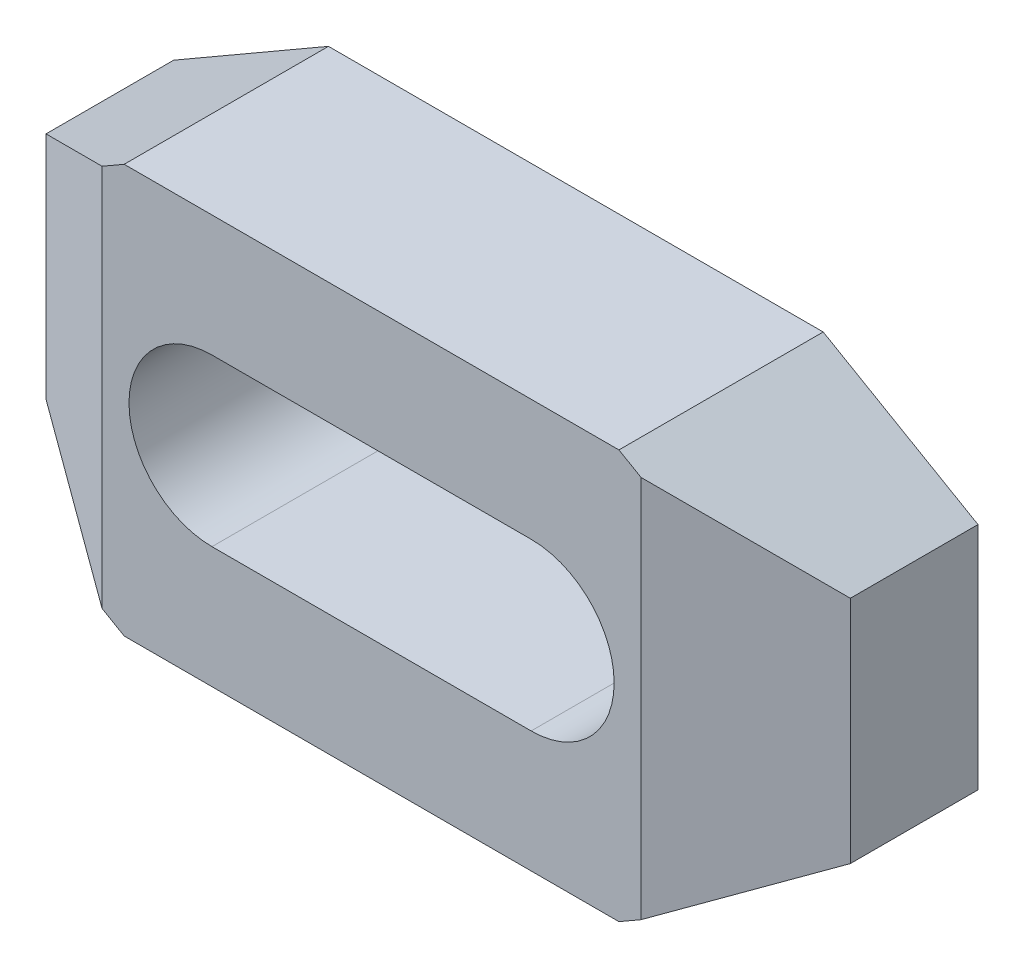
ISO-10303-21;
HEADER;
FILE_DESCRIPTION(('STEP AP214'),'2;1');
FILE_NAME('part.step','',(''),(''),'','','');
FILE_SCHEMA(('AUTOMOTIVE_DESIGN { 1 0 10303 214 1 1 1 1 }'));
ENDSEC;
DATA;
#1=APPLICATION_CONTEXT('core data for automotive mechanical design processes');
#2=APPLICATION_PROTOCOL_DEFINITION('international standard','automotive_design',2000,#1);
#3=PRODUCT_CONTEXT('',#1,'mechanical');
#4=PRODUCT('Part','Part','',(#3));
#5=PRODUCT_RELATED_PRODUCT_CATEGORY('part','',(#4));
#6=PRODUCT_DEFINITION_FORMATION('','',#4);
#7=PRODUCT_DEFINITION_CONTEXT('part definition',#1,'design');
#8=PRODUCT_DEFINITION('design','',#6,#7);
#9=PRODUCT_DEFINITION_SHAPE('','',#8);
#10=(LENGTH_UNIT() NAMED_UNIT(*) SI_UNIT(.MILLI.,.METRE.));
#11=(NAMED_UNIT(*) PLANE_ANGLE_UNIT() SI_UNIT($,.RADIAN.));
#12=(NAMED_UNIT(*) SI_UNIT($,.STERADIAN.) SOLID_ANGLE_UNIT());
#13=UNCERTAINTY_MEASURE_WITH_UNIT(LENGTH_MEASURE(1.E-05),#10,'distance_accuracy_value','');
#14=(GEOMETRIC_REPRESENTATION_CONTEXT(3) GLOBAL_UNCERTAINTY_ASSIGNED_CONTEXT((#13)) GLOBAL_UNIT_ASSIGNED_CONTEXT((#10,
#11,#12)) REPRESENTATION_CONTEXT('',''));
#15=CARTESIAN_POINT('',(0.,0.,0.));
#16=DIRECTION('',(0.,0.,1.));
#17=DIRECTION('',(1.,0.,0.));
#18=AXIS2_PLACEMENT_3D('',#15,#16,#17);
#19=CARTESIAN_POINT('',(0.,-27.1865334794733,16.));
#20=DIRECTION('',(0.,0.,-1.));
#21=DIRECTION('',(-1.,0.,0.));
#22=AXIS2_PLACEMENT_3D('',#19,#20,#21);
#23=PLANE('',#22);
#24=CARTESIAN_POINT('',(12.5,0.,16.));
#25=DIRECTION('',(0.,0.,1.));
#26=DIRECTION('',(1.,0.,0.));
#27=AXIS2_PLACEMENT_3D('',#24,#25,#26);
#28=CIRCLE('',#27,6.5);
#29=CARTESIAN_POINT('',(12.5,-6.5,16.));
#30=VERTEX_POINT('',#29);
#31=CARTESIAN_POINT('',(12.5,6.5,16.));
#32=VERTEX_POINT('',#31);
#33=EDGE_CURVE('E221',#30,#32,#28,.T.);
#34=ORIENTED_EDGE('',*,*,#33,.F.);
#35=DIRECTION('',(-1.,0.,0.));
#36=VECTOR('',#35,1.);
#37=CARTESIAN_POINT('',(12.5,-6.5,16.));
#38=LINE('',#37,#36);
#39=CARTESIAN_POINT('',(-12.5,-6.5,16.));
#40=VERTEX_POINT('',#39);
#41=EDGE_CURVE('E220',#30,#40,#38,.T.);
#42=ORIENTED_EDGE('',*,*,#41,.T.);
#43=CARTESIAN_POINT('',(-12.5,0.,16.));
#44=DIRECTION('',(0.,0.,1.));
#45=DIRECTION('',(1.,0.,0.));
#46=AXIS2_PLACEMENT_3D('',#43,#44,#45);
#47=CIRCLE('',#46,6.5);
#48=CARTESIAN_POINT('',(-12.5,6.5,16.));
#49=VERTEX_POINT('',#48);
#50=EDGE_CURVE('E228',#49,#40,#47,.T.);
#51=ORIENTED_EDGE('',*,*,#50,.F.);
#52=DIRECTION('',(-1.,0.,0.));
#53=VECTOR('',#52,1.);
#54=CARTESIAN_POINT('',(12.5,6.5,16.));
#55=LINE('',#54,#53);
#56=EDGE_CURVE('E224',#32,#49,#55,.T.);
#57=ORIENTED_EDGE('',*,*,#56,.F.);
#58=EDGE_LOOP('',(#34,#42,#51,#57));
#59=FACE_BOUND('',#58,.T.);
#60=DIRECTION('',(0.,1.,0.));
#61=VECTOR('',#60,1.);
#62=CARTESIAN_POINT('',(-21.1076951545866,-27.1865334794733,16.));
#63=LINE('',#62,#61);
#64=CARTESIAN_POINT('',(-21.1076951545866,-15.,16.));
#65=VERTEX_POINT('',#64);
#66=CARTESIAN_POINT('',(-21.1076951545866,15.,16.));
#67=VERTEX_POINT('',#66);
#68=EDGE_CURVE('E115',#65,#67,#63,.T.);
#69=ORIENTED_EDGE('',*,*,#68,.F.);
#70=DIRECTION('',(-0.866025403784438,0.5,0.));
#71=VECTOR('',#70,1.);
#72=CARTESIAN_POINT('',(-19.3756443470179,-16.,16.));
#73=LINE('',#72,#71);
#74=CARTESIAN_POINT('',(-19.3756443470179,-16.,16.));
#75=VERTEX_POINT('',#74);
#76=EDGE_CURVE('E174',#75,#65,#73,.T.);
#77=ORIENTED_EDGE('',*,*,#76,.F.);
#78=DIRECTION('',(-1.,0.,0.));
#79=VECTOR('',#78,1.);
#80=CARTESIAN_POINT('',(19.3756443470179,-16.,16.));
#81=LINE('',#80,#79);
#82=CARTESIAN_POINT('',(19.3756443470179,-16.,16.));
#83=VERTEX_POINT('',#82);
#84=EDGE_CURVE('E177',#83,#75,#81,.T.);
#85=ORIENTED_EDGE('',*,*,#84,.F.);
#86=DIRECTION('',(-0.866025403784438,-0.5,0.));
#87=VECTOR('',#86,1.);
#88=CARTESIAN_POINT('',(31.5,-9.,16.));
#89=LINE('',#88,#87);
#90=CARTESIAN_POINT('',(21.1076951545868,-15.,16.));
#91=VERTEX_POINT('',#90);
#92=EDGE_CURVE('E157',#91,#83,#89,.T.);
#93=ORIENTED_EDGE('',*,*,#92,.F.);
#94=DIRECTION('',(0.,1.,0.));
#95=VECTOR('',#94,1.);
#96=CARTESIAN_POINT('',(21.1076951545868,-27.1865334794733,16.));
#97=LINE('',#96,#95);
#98=CARTESIAN_POINT('',(21.1076951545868,15.,16.));
#99=VERTEX_POINT('',#98);
#100=EDGE_CURVE('E146',#91,#99,#97,.T.);
#101=ORIENTED_EDGE('',*,*,#100,.T.);
#102=DIRECTION('',(0.866025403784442,-0.5,0.));
#103=VECTOR('',#102,1.);
#104=CARTESIAN_POINT('',(19.3756443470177,16.,16.));
#105=LINE('',#104,#103);
#106=CARTESIAN_POINT('',(19.3756443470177,16.,16.));
#107=VERTEX_POINT('',#106);
#108=EDGE_CURVE('E155',#107,#99,#105,.T.);
#109=ORIENTED_EDGE('',*,*,#108,.F.);
#110=DIRECTION('',(1.,0.,0.));
#111=VECTOR('',#110,1.);
#112=CARTESIAN_POINT('',(-19.3756443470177,16.,16.));
#113=LINE('',#112,#111);
#114=CARTESIAN_POINT('',(-19.3756443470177,16.,16.));
#115=VERTEX_POINT('',#114);
#116=EDGE_CURVE('E164',#115,#107,#113,.T.);
#117=ORIENTED_EDGE('',*,*,#116,.F.);
#118=DIRECTION('',(0.866025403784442,0.5,0.));
#119=VECTOR('',#118,1.);
#120=CARTESIAN_POINT('',(-31.5,9.,16.));
#121=LINE('',#120,#119);
#122=EDGE_CURVE('E167',#67,#115,#121,.T.);
#123=ORIENTED_EDGE('',*,*,#122,.F.);
#124=EDGE_LOOP('',(#69,#77,#85,#93,#101,#109,#117,#123));
#125=FACE_BOUND('',#124,.T.);
#126=ADVANCED_FACE('F14',(#59,#125),#23,.F.);
#127=CARTESIAN_POINT('',(-31.5,9.,16.));
#128=DIRECTION('',(-0.5,0.866025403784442,0.));
#129=DIRECTION('',(-0.866025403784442,-0.5,0.));
#130=AXIS2_PLACEMENT_3D('',#127,#128,#129);
#131=PLANE('',#130);
#132=DIRECTION('',(0.,0.,-1.));
#133=VECTOR('',#132,1.);
#134=CARTESIAN_POINT('',(-31.5,9.,16.));
#135=LINE('',#134,#133);
#136=CARTESIAN_POINT('',(-31.5,9.,10.));
#137=VERTEX_POINT('',#136);
#138=CARTESIAN_POINT('',(-31.5,9.,0.));
#139=VERTEX_POINT('',#138);
#140=EDGE_CURVE('E124',#137,#139,#135,.T.);
#141=ORIENTED_EDGE('',*,*,#140,.F.);
#142=DIRECTION('',(0.774596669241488,0.447213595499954,0.447213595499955));
#143=VECTOR('',#142,1.);
#144=CARTESIAN_POINT('',(-29.4215390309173,10.2,11.2));
#145=LINE('',#144,#143);
#146=EDGE_CURVE('E112',#137,#67,#145,.T.);
#147=ORIENTED_EDGE('',*,*,#146,.T.);
#148=ORIENTED_EDGE('',*,*,#122,.T.);
#149=DIRECTION('',(0.,0.,-1.));
#150=VECTOR('',#149,1.);
#151=CARTESIAN_POINT('',(-19.3756443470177,16.,16.));
#152=LINE('',#151,#150);
#153=CARTESIAN_POINT('',(-19.3756443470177,16.,0.));
#154=VERTEX_POINT('',#153);
#155=EDGE_CURVE('E132',#115,#154,#152,.T.);
#156=ORIENTED_EDGE('',*,*,#155,.T.);
#157=DIRECTION('',(0.866025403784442,0.5,0.));
#158=VECTOR('',#157,1.);
#159=CARTESIAN_POINT('',(-31.5,9.,0.));
#160=LINE('',#159,#158);
#161=EDGE_CURVE('E131',#139,#154,#160,.T.);
#162=ORIENTED_EDGE('',*,*,#161,.F.);
#163=EDGE_LOOP('',(#141,#147,#148,#156,#162));
#164=FACE_BOUND('',#163,.T.);
#165=ADVANCED_FACE('F129',(#164),#131,.T.);
#166=CARTESIAN_POINT('',(-31.5,-9.,16.));
#167=DIRECTION('',(-1.,0.,0.));
#168=DIRECTION('',(0.,0.,1.));
#169=AXIS2_PLACEMENT_3D('',#166,#167,#168);
#170=PLANE('',#169);
#171=DIRECTION('',(0.,0.,-1.));
#172=VECTOR('',#171,1.);
#173=CARTESIAN_POINT('',(-31.5,-9.,16.));
#174=LINE('',#173,#172);
#175=CARTESIAN_POINT('',(-31.5,-9.,10.));
#176=VERTEX_POINT('',#175);
#177=CARTESIAN_POINT('',(-31.5,-9.,0.));
#178=VERTEX_POINT('',#177);
#179=EDGE_CURVE('E126',#176,#178,#174,.T.);
#180=ORIENTED_EDGE('',*,*,#179,.F.);
#181=DIRECTION('',(0.,1.,0.));
#182=VECTOR('',#181,1.);
#183=CARTESIAN_POINT('',(-31.5,-20.,10.));
#184=LINE('',#183,#182);
#185=EDGE_CURVE('E29',#176,#137,#184,.T.);
#186=ORIENTED_EDGE('',*,*,#185,.T.);
#187=ORIENTED_EDGE('',*,*,#140,.T.);
#188=DIRECTION('',(0.,1.,0.));
#189=VECTOR('',#188,1.);
#190=CARTESIAN_POINT('',(-31.5,-9.,0.));
#191=LINE('',#190,#189);
#192=EDGE_CURVE('E199',#178,#139,#191,.T.);
#193=ORIENTED_EDGE('',*,*,#192,.F.);
#194=EDGE_LOOP('',(#180,#186,#187,#193));
#195=FACE_BOUND('',#194,.T.);
#196=ADVANCED_FACE('F122',(#195),#170,.T.);
#197=CARTESIAN_POINT('',(-19.3756443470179,-16.,16.));
#198=DIRECTION('',(-0.5,-0.866025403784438,0.));
#199=DIRECTION('',(0.866025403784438,-0.5,0.));
#200=AXIS2_PLACEMENT_3D('',#197,#198,#199);
#201=PLANE('',#200);
#202=ORIENTED_EDGE('',*,*,#76,.T.);
#203=DIRECTION('',(-0.774596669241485,0.447213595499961,-0.447213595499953));
#204=VECTOR('',#203,1.);
#205=CARTESIAN_POINT('',(-19.7220545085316,-15.8,16.8));
#206=LINE('',#205,#204);
#207=EDGE_CURVE('E9',#65,#176,#206,.T.);
#208=ORIENTED_EDGE('',*,*,#207,.T.);
#209=ORIENTED_EDGE('',*,*,#179,.T.);
#210=DIRECTION('',(-0.866025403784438,0.5,0.));
#211=VECTOR('',#210,1.);
#212=CARTESIAN_POINT('',(-19.3756443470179,-16.,0.));
#213=LINE('',#212,#211);
#214=CARTESIAN_POINT('',(-19.3756443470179,-16.,0.));
#215=VERTEX_POINT('',#214);
#216=EDGE_CURVE('E195',#215,#178,#213,.T.);
#217=ORIENTED_EDGE('',*,*,#216,.F.);
#218=DIRECTION('',(0.,0.,-1.));
#219=VECTOR('',#218,1.);
#220=CARTESIAN_POINT('',(-19.3756443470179,-16.,16.));
#221=LINE('',#220,#219);
#222=EDGE_CURVE('E136',#75,#215,#221,.T.);
#223=ORIENTED_EDGE('',*,*,#222,.F.);
#224=EDGE_LOOP('',(#202,#208,#209,#217,#223));
#225=FACE_BOUND('',#224,.T.);
#226=ADVANCED_FACE('F198',(#225),#201,.T.);
#227=CARTESIAN_POINT('',(0.,-27.1865334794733,0.));
#228=DIRECTION('',(0.,0.,-1.));
#229=DIRECTION('',(-1.,0.,0.));
#230=AXIS2_PLACEMENT_3D('',#227,#228,#229);
#231=PLANE('',#230);
#232=DIRECTION('',(-0.866025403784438,-0.5,0.));
#233=VECTOR('',#232,1.);
#234=CARTESIAN_POINT('',(31.5,-9.,0.));
#235=LINE('',#234,#233);
#236=CARTESIAN_POINT('',(31.5,-9.,0.));
#237=VERTEX_POINT('',#236);
#238=CARTESIAN_POINT('',(19.3756443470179,-16.,0.));
#239=VERTEX_POINT('',#238);
#240=EDGE_CURVE('E170',#237,#239,#235,.T.);
#241=ORIENTED_EDGE('',*,*,#240,.T.);
#242=DIRECTION('',(-1.,0.,0.));
#243=VECTOR('',#242,1.);
#244=CARTESIAN_POINT('',(19.3756443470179,-16.,0.));
#245=LINE('',#244,#243);
#246=EDGE_CURVE('E186',#239,#215,#245,.T.);
#247=ORIENTED_EDGE('',*,*,#246,.T.);
#248=ORIENTED_EDGE('',*,*,#216,.T.);
#249=ORIENTED_EDGE('',*,*,#192,.T.);
#250=ORIENTED_EDGE('',*,*,#161,.T.);
#251=DIRECTION('',(1.,0.,0.));
#252=VECTOR('',#251,1.);
#253=CARTESIAN_POINT('',(-19.3756443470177,16.,0.));
#254=LINE('',#253,#252);
#255=CARTESIAN_POINT('',(19.3756443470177,16.,0.));
#256=VERTEX_POINT('',#255);
#257=EDGE_CURVE('E204',#154,#256,#254,.T.);
#258=ORIENTED_EDGE('',*,*,#257,.T.);
#259=DIRECTION('',(0.866025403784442,-0.5,0.));
#260=VECTOR('',#259,1.);
#261=CARTESIAN_POINT('',(19.3756443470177,16.,0.));
#262=LINE('',#261,#260);
#263=CARTESIAN_POINT('',(31.5,9.,0.));
#264=VERTEX_POINT('',#263);
#265=EDGE_CURVE('E207',#256,#264,#262,.T.);
#266=ORIENTED_EDGE('',*,*,#265,.T.);
#267=DIRECTION('',(0.,-1.,0.));
#268=VECTOR('',#267,1.);
#269=CARTESIAN_POINT('',(31.5,9.,0.));
#270=LINE('',#269,#268);
#271=EDGE_CURVE('E180',#264,#237,#270,.T.);
#272=ORIENTED_EDGE('',*,*,#271,.T.);
#273=EDGE_LOOP('',(#241,#247,#248,#249,#250,#258,#266,#272));
#274=FACE_BOUND('',#273,.T.);
#275=DIRECTION('',(-1.,0.,0.));
#276=VECTOR('',#275,1.);
#277=CARTESIAN_POINT('',(12.5,-6.5,0.));
#278=LINE('',#277,#276);
#279=CARTESIAN_POINT('',(12.5,-6.5,0.));
#280=VERTEX_POINT('',#279);
#281=CARTESIAN_POINT('',(-12.5,-6.5,0.));
#282=VERTEX_POINT('',#281);
#283=EDGE_CURVE('E225',#280,#282,#278,.T.);
#284=ORIENTED_EDGE('',*,*,#283,.F.);
#285=CARTESIAN_POINT('',(12.5,0.,0.));
#286=DIRECTION('',(0.,0.,1.));
#287=DIRECTION('',(1.,0.,0.));
#288=AXIS2_PLACEMENT_3D('',#285,#286,#287);
#289=CIRCLE('',#288,6.5);
#290=CARTESIAN_POINT('',(12.5,6.5,0.));
#291=VERTEX_POINT('',#290);
#292=EDGE_CURVE('E232',#280,#291,#289,.T.);
#293=ORIENTED_EDGE('',*,*,#292,.T.);
#294=DIRECTION('',(-1.,0.,0.));
#295=VECTOR('',#294,1.);
#296=CARTESIAN_POINT('',(12.5,6.5,0.));
#297=LINE('',#296,#295);
#298=CARTESIAN_POINT('',(-12.5,6.5,0.));
#299=VERTEX_POINT('',#298);
#300=EDGE_CURVE('E235',#291,#299,#297,.T.);
#301=ORIENTED_EDGE('',*,*,#300,.T.);
#302=CARTESIAN_POINT('',(-12.5,0.,0.));
#303=DIRECTION('',(0.,0.,1.));
#304=DIRECTION('',(1.,0.,0.));
#305=AXIS2_PLACEMENT_3D('',#302,#303,#304);
#306=CIRCLE('',#305,6.5);
#307=EDGE_CURVE('E238',#299,#282,#306,.T.);
#308=ORIENTED_EDGE('',*,*,#307,.T.);
#309=EDGE_LOOP('',(#284,#293,#301,#308));
#310=FACE_BOUND('',#309,.T.);
#311=ADVANCED_FACE('F193',(#274,#310),#231,.T.);
#312=CARTESIAN_POINT('',(31.5,-9.,16.));
#313=DIRECTION('',(0.5,-0.866025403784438,0.));
#314=DIRECTION('',(0.866025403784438,0.5,0.));
#315=AXIS2_PLACEMENT_3D('',#312,#313,#314);
#316=PLANE('',#315);
#317=DIRECTION('',(0.774596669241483,0.447213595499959,-0.447213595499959));
#318=VECTOR('',#317,1.);
#319=CARTESIAN_POINT('',(29.4215390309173,-10.2,11.2));
#320=LINE('',#319,#318);
#321=CARTESIAN_POINT('',(31.5,-9.,10.));
#322=VERTEX_POINT('',#321);
#323=EDGE_CURVE('E158',#91,#322,#320,.T.);
#324=ORIENTED_EDGE('',*,*,#323,.F.);
#325=ORIENTED_EDGE('',*,*,#92,.T.);
#326=DIRECTION('',(0.,0.,-1.));
#327=VECTOR('',#326,1.);
#328=CARTESIAN_POINT('',(19.3756443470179,-16.,16.));
#329=LINE('',#328,#327);
#330=EDGE_CURVE('E163',#83,#239,#329,.T.);
#331=ORIENTED_EDGE('',*,*,#330,.T.);
#332=ORIENTED_EDGE('',*,*,#240,.F.);
#333=DIRECTION('',(0.,0.,-1.));
#334=VECTOR('',#333,1.);
#335=CARTESIAN_POINT('',(31.5,-9.,16.));
#336=LINE('',#335,#334);
#337=EDGE_CURVE('E143',#322,#237,#336,.T.);
#338=ORIENTED_EDGE('',*,*,#337,.F.);
#339=EDGE_LOOP('',(#324,#325,#331,#332,#338));
#340=FACE_BOUND('',#339,.T.);
#341=ADVANCED_FACE('F249',(#340),#316,.T.);
#342=CARTESIAN_POINT('',(31.5,9.,16.));
#343=DIRECTION('',(1.,0.,0.));
#344=DIRECTION('',(0.,0.,-1.));
#345=AXIS2_PLACEMENT_3D('',#342,#343,#344);
#346=PLANE('',#345);
#347=DIRECTION('',(0.,1.,0.));
#348=VECTOR('',#347,1.);
#349=CARTESIAN_POINT('',(31.5,-20.,10.));
#350=LINE('',#349,#348);
#351=CARTESIAN_POINT('',(31.5,9.,10.));
#352=VERTEX_POINT('',#351);
#353=EDGE_CURVE('E36',#322,#352,#350,.T.);
#354=ORIENTED_EDGE('',*,*,#353,.F.);
#355=ORIENTED_EDGE('',*,*,#337,.T.);
#356=ORIENTED_EDGE('',*,*,#271,.F.);
#357=DIRECTION('',(0.,0.,-1.));
#358=VECTOR('',#357,1.);
#359=CARTESIAN_POINT('',(31.5,9.,16.));
#360=LINE('',#359,#358);
#361=EDGE_CURVE('E141',#352,#264,#360,.T.);
#362=ORIENTED_EDGE('',*,*,#361,.F.);
#363=EDGE_LOOP('',(#354,#355,#356,#362));
#364=FACE_BOUND('',#363,.T.);
#365=ADVANCED_FACE('F16',(#364),#346,.T.);
#366=CARTESIAN_POINT('',(19.3756443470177,16.,16.));
#367=DIRECTION('',(0.5,0.866025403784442,0.));
#368=DIRECTION('',(-0.866025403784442,0.5,0.));
#369=AXIS2_PLACEMENT_3D('',#366,#367,#368);
#370=PLANE('',#369);
#371=DIRECTION('',(-0.774596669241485,0.447213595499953,0.44721359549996));
#372=VECTOR('',#371,1.);
#373=CARTESIAN_POINT('',(19.7220545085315,15.8,16.8));
#374=LINE('',#373,#372);
#375=EDGE_CURVE('E22',#352,#99,#374,.T.);
#376=ORIENTED_EDGE('',*,*,#375,.F.);
#377=ORIENTED_EDGE('',*,*,#361,.T.);
#378=ORIENTED_EDGE('',*,*,#265,.F.);
#379=DIRECTION('',(0.,0.,-1.));
#380=VECTOR('',#379,1.);
#381=CARTESIAN_POINT('',(19.3756443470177,16.,16.));
#382=LINE('',#381,#380);
#383=EDGE_CURVE('E134',#107,#256,#382,.T.);
#384=ORIENTED_EDGE('',*,*,#383,.F.);
#385=ORIENTED_EDGE('',*,*,#108,.T.);
#386=EDGE_LOOP('',(#376,#377,#378,#384,#385));
#387=FACE_BOUND('',#386,.T.);
#388=ADVANCED_FACE('F160',(#387),#370,.T.);
#389=CARTESIAN_POINT('',(-19.3756443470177,16.,16.));
#390=DIRECTION('',(0.,1.,0.));
#391=DIRECTION('',(-1.,0.,0.));
#392=AXIS2_PLACEMENT_3D('',#389,#390,#391);
#393=PLANE('',#392);
#394=ORIENTED_EDGE('',*,*,#155,.F.);
#395=ORIENTED_EDGE('',*,*,#116,.T.);
#396=ORIENTED_EDGE('',*,*,#383,.T.);
#397=ORIENTED_EDGE('',*,*,#257,.F.);
#398=EDGE_LOOP('',(#394,#395,#396,#397));
#399=FACE_BOUND('',#398,.T.);
#400=ADVANCED_FACE('F253',(#399),#393,.T.);
#401=CARTESIAN_POINT('',(19.3756443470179,-16.,16.));
#402=DIRECTION('',(0.,-1.,0.));
#403=DIRECTION('',(1.,0.,0.));
#404=AXIS2_PLACEMENT_3D('',#401,#402,#403);
#405=PLANE('',#404);
#406=ORIENTED_EDGE('',*,*,#84,.T.);
#407=ORIENTED_EDGE('',*,*,#222,.T.);
#408=ORIENTED_EDGE('',*,*,#246,.F.);
#409=ORIENTED_EDGE('',*,*,#330,.F.);
#410=EDGE_LOOP('',(#406,#407,#408,#409));
#411=FACE_BOUND('',#410,.T.);
#412=ADVANCED_FACE('F184',(#411),#405,.T.);
#413=CARTESIAN_POINT('',(12.5,0.,16.));
#414=DIRECTION('',(0.,0.,-1.));
#415=DIRECTION('',(-1.,0.,0.));
#416=AXIS2_PLACEMENT_3D('',#413,#414,#415);
#417=CYLINDRICAL_SURFACE('',#416,6.5);
#418=DIRECTION('',(0.,0.,-1.));
#419=VECTOR('',#418,1.);
#420=CARTESIAN_POINT('',(12.5,6.5,16.));
#421=LINE('',#420,#419);
#422=EDGE_CURVE('E211',#32,#291,#421,.T.);
#423=ORIENTED_EDGE('',*,*,#422,.T.);
#424=ORIENTED_EDGE('',*,*,#292,.F.);
#425=DIRECTION('',(0.,0.,-1.));
#426=VECTOR('',#425,1.);
#427=CARTESIAN_POINT('',(12.5,-6.5,16.));
#428=LINE('',#427,#426);
#429=EDGE_CURVE('E217',#30,#280,#428,.T.);
#430=ORIENTED_EDGE('',*,*,#429,.F.);
#431=ORIENTED_EDGE('',*,*,#33,.T.);
#432=EDGE_LOOP('',(#423,#424,#430,#431));
#433=FACE_BOUND('',#432,.T.);
#434=ADVANCED_FACE('F261',(#433),#417,.F.);
#435=CARTESIAN_POINT('',(12.5,6.5,16.));
#436=DIRECTION('',(0.,-1.,0.));
#437=DIRECTION('',(1.,0.,0.));
#438=AXIS2_PLACEMENT_3D('',#435,#436,#437);
#439=PLANE('',#438);
#440=DIRECTION('',(0.,0.,-1.));
#441=VECTOR('',#440,1.);
#442=CARTESIAN_POINT('',(-12.5,6.5,16.));
#443=LINE('',#442,#441);
#444=EDGE_CURVE('E213',#49,#299,#443,.T.);
#445=ORIENTED_EDGE('',*,*,#444,.T.);
#446=ORIENTED_EDGE('',*,*,#300,.F.);
#447=ORIENTED_EDGE('',*,*,#422,.F.);
#448=ORIENTED_EDGE('',*,*,#56,.T.);
#449=EDGE_LOOP('',(#445,#446,#447,#448));
#450=FACE_BOUND('',#449,.T.);
#451=ADVANCED_FACE('F336',(#450),#439,.T.);
#452=CARTESIAN_POINT('',(-12.5,0.,16.));
#453=DIRECTION('',(0.,0.,-1.));
#454=DIRECTION('',(-1.,0.,0.));
#455=AXIS2_PLACEMENT_3D('',#452,#453,#454);
#456=CYLINDRICAL_SURFACE('',#455,6.5);
#457=DIRECTION('',(0.,0.,-1.));
#458=VECTOR('',#457,1.);
#459=CARTESIAN_POINT('',(-12.5,-6.5,16.));
#460=LINE('',#459,#458);
#461=EDGE_CURVE('E215',#40,#282,#460,.T.);
#462=ORIENTED_EDGE('',*,*,#461,.T.);
#463=ORIENTED_EDGE('',*,*,#307,.F.);
#464=ORIENTED_EDGE('',*,*,#444,.F.);
#465=ORIENTED_EDGE('',*,*,#50,.T.);
#466=EDGE_LOOP('',(#462,#463,#464,#465));
#467=FACE_BOUND('',#466,.T.);
#468=ADVANCED_FACE('F346',(#467),#456,.F.);
#469=CARTESIAN_POINT('',(12.5,-6.5,16.));
#470=DIRECTION('',(0.,-1.,0.));
#471=DIRECTION('',(1.,0.,0.));
#472=AXIS2_PLACEMENT_3D('',#469,#470,#471);
#473=PLANE('',#472);
#474=ORIENTED_EDGE('',*,*,#41,.F.);
#475=ORIENTED_EDGE('',*,*,#429,.T.);
#476=ORIENTED_EDGE('',*,*,#283,.T.);
#477=ORIENTED_EDGE('',*,*,#461,.F.);
#478=EDGE_LOOP('',(#474,#475,#476,#477));
#479=FACE_BOUND('',#478,.T.);
#480=ADVANCED_FACE('F355',(#479),#473,.F.);
#481=CARTESIAN_POINT('',(31.5,-20.,10.));
#482=DIRECTION('',(-0.5,0.,-0.866025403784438));
#483=DIRECTION('',(-0.866025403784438,0.,0.5));
#484=AXIS2_PLACEMENT_3D('',#481,#482,#483);
#485=PLANE('',#484);
#486=ORIENTED_EDGE('',*,*,#323,.T.);
#487=ORIENTED_EDGE('',*,*,#353,.T.);
#488=ORIENTED_EDGE('',*,*,#375,.T.);
#489=ORIENTED_EDGE('',*,*,#100,.F.);
#490=EDGE_LOOP('',(#486,#487,#488,#489));
#491=FACE_BOUND('',#490,.T.);
#492=ADVANCED_FACE('F145',(#491),#485,.F.);
#493=CARTESIAN_POINT('',(-31.5,-20.,10.));
#494=DIRECTION('',(-0.5,0.,0.866025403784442));
#495=DIRECTION('',(0.866025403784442,0.,0.5));
#496=AXIS2_PLACEMENT_3D('',#493,#494,#495);
#497=PLANE('',#496);
#498=ORIENTED_EDGE('',*,*,#185,.F.);
#499=ORIENTED_EDGE('',*,*,#207,.F.);
#500=ORIENTED_EDGE('',*,*,#68,.T.);
#501=ORIENTED_EDGE('',*,*,#146,.F.);
#502=EDGE_LOOP('',(#498,#499,#500,#501));
#503=FACE_BOUND('',#502,.T.);
#504=ADVANCED_FACE('F113',(#503),#497,.T.);
#505=CLOSED_SHELL('',(#126,#165,#196,#226,#311,#341,#365,#388,#400,#412,#434,#451,#468,#480,
#492,#504));
#506=MANIFOLD_SOLID_BREP('B1',#505);
#507=ADVANCED_BREP_SHAPE_REPRESENTATION('',(#18,#506),#14);
#508=SHAPE_DEFINITION_REPRESENTATION(#9,#507);
ENDSEC;
END-ISO-10303-21;
